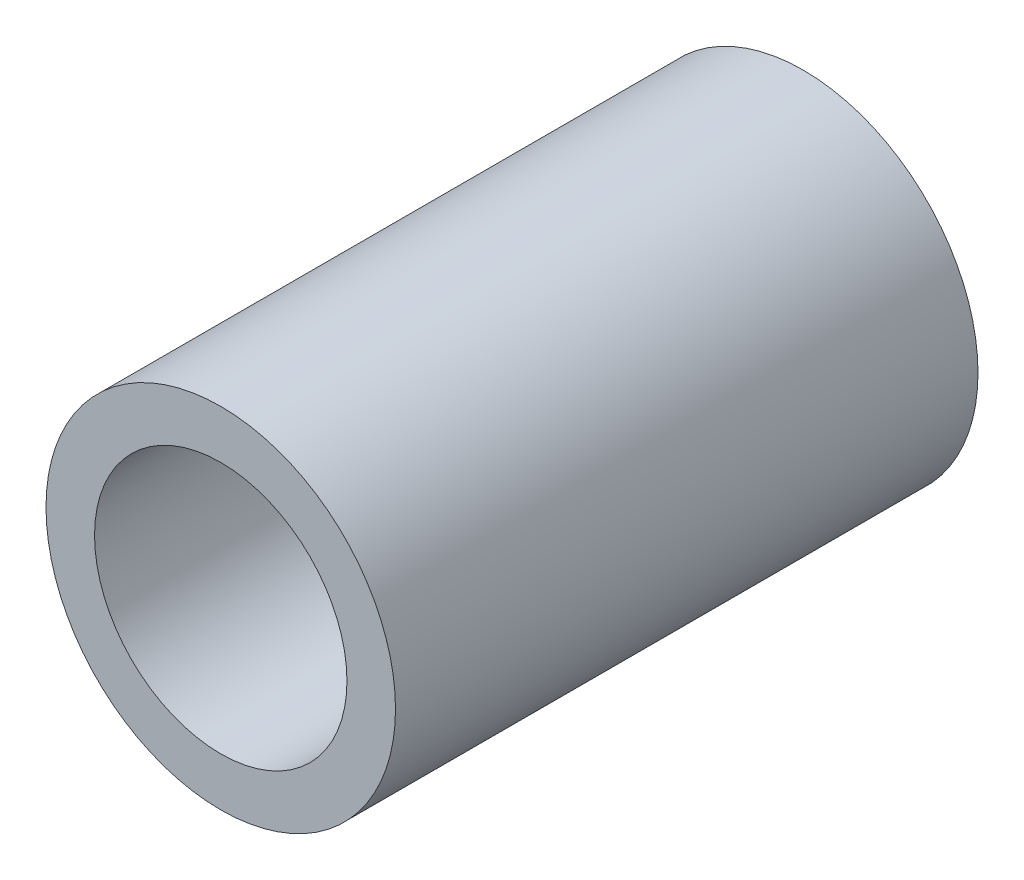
ISO-10303-21;
HEADER;
FILE_DESCRIPTION(('STEP AP214'),'2;1');
FILE_NAME('part.step','',(''),(''),'','','');
FILE_SCHEMA(('AUTOMOTIVE_DESIGN { 1 0 10303 214 1 1 1 1 }'));
ENDSEC;
DATA;
#1=APPLICATION_CONTEXT('core data for automotive mechanical design processes');
#2=APPLICATION_PROTOCOL_DEFINITION('international standard','automotive_design',2000,#1);
#3=PRODUCT_CONTEXT('',#1,'mechanical');
#4=PRODUCT('Part','Part','',(#3));
#5=PRODUCT_RELATED_PRODUCT_CATEGORY('part','',(#4));
#6=PRODUCT_DEFINITION_FORMATION('','',#4);
#7=PRODUCT_DEFINITION_CONTEXT('part definition',#1,'design');
#8=PRODUCT_DEFINITION('design','',#6,#7);
#9=PRODUCT_DEFINITION_SHAPE('','',#8);
#10=(LENGTH_UNIT() NAMED_UNIT(*) SI_UNIT(.MILLI.,.METRE.));
#11=(NAMED_UNIT(*) PLANE_ANGLE_UNIT() SI_UNIT($,.RADIAN.));
#12=(NAMED_UNIT(*) SI_UNIT($,.STERADIAN.) SOLID_ANGLE_UNIT());
#13=UNCERTAINTY_MEASURE_WITH_UNIT(LENGTH_MEASURE(1.E-05),#10,'distance_accuracy_value','');
#14=(GEOMETRIC_REPRESENTATION_CONTEXT(3) GLOBAL_UNCERTAINTY_ASSIGNED_CONTEXT((#13)) GLOBAL_UNIT_ASSIGNED_CONTEXT((#10,
#11,#12)) REPRESENTATION_CONTEXT('',''));
#15=CARTESIAN_POINT('',(0.,0.,0.));
#16=DIRECTION('',(0.,0.,1.));
#17=DIRECTION('',(1.,0.,0.));
#18=AXIS2_PLACEMENT_3D('',#15,#16,#17);
#19=CARTESIAN_POINT('',(0.,0.,30.));
#20=DIRECTION('',(0.,0.,1.));
#21=DIRECTION('',(1.,0.,0.));
#22=AXIS2_PLACEMENT_3D('',#19,#20,#21);
#23=PLANE('',#22);
#24=CARTESIAN_POINT('',(0.,0.,30.));
#25=DIRECTION('',(0.,0.,1.));
#26=DIRECTION('',(1.,0.,0.));
#27=AXIS2_PLACEMENT_3D('',#24,#25,#26);
#28=CIRCLE('',#27,9.);
#29=CARTESIAN_POINT('',(9.,0.,30.));
#30=VERTEX_POINT('',#29);
#31=EDGE_CURVE('E10',#30,#30,#28,.T.);
#32=ORIENTED_EDGE('',*,*,#31,.T.);
#33=EDGE_LOOP('',(#32));
#34=FACE_BOUND('',#33,.T.);
#35=CARTESIAN_POINT('',(0.,0.,30.));
#36=DIRECTION('',(0.,0.,1.));
#37=DIRECTION('',(1.,0.,0.));
#38=AXIS2_PLACEMENT_3D('',#35,#36,#37);
#39=CIRCLE('',#38,6.5);
#40=CARTESIAN_POINT('',(6.5,0.,30.));
#41=VERTEX_POINT('',#40);
#42=EDGE_CURVE('E41',#41,#41,#39,.T.);
#43=ORIENTED_EDGE('',*,*,#42,.F.);
#44=EDGE_LOOP('',(#43));
#45=FACE_BOUND('',#44,.T.);
#46=ADVANCED_FACE('F30',(#34,#45),#23,.T.);
#47=CARTESIAN_POINT('',(0.,0.,0.));
#48=DIRECTION('',(0.,0.,1.));
#49=DIRECTION('',(1.,0.,0.));
#50=AXIS2_PLACEMENT_3D('',#47,#48,#49);
#51=PLANE('',#50);
#52=CARTESIAN_POINT('',(0.,0.,0.));
#53=DIRECTION('',(0.,0.,1.));
#54=DIRECTION('',(1.,0.,0.));
#55=AXIS2_PLACEMENT_3D('',#52,#53,#54);
#56=CIRCLE('',#55,9.);
#57=CARTESIAN_POINT('',(9.,0.,0.));
#58=VERTEX_POINT('',#57);
#59=EDGE_CURVE('E34',#58,#58,#56,.T.);
#60=ORIENTED_EDGE('',*,*,#59,.F.);
#61=EDGE_LOOP('',(#60));
#62=FACE_BOUND('',#61,.T.);
#63=CARTESIAN_POINT('',(0.,0.,0.));
#64=DIRECTION('',(0.,0.,1.));
#65=DIRECTION('',(1.,0.,0.));
#66=AXIS2_PLACEMENT_3D('',#63,#64,#65);
#67=CIRCLE('',#66,6.5);
#68=CARTESIAN_POINT('',(6.5,0.,0.));
#69=VERTEX_POINT('',#68);
#70=EDGE_CURVE('E43',#69,#69,#67,.T.);
#71=ORIENTED_EDGE('',*,*,#70,.T.);
#72=EDGE_LOOP('',(#71));
#73=FACE_BOUND('',#72,.T.);
#74=ADVANCED_FACE('F53',(#62,#73),#51,.F.);
#75=CARTESIAN_POINT('',(0.,0.,30.));
#76=DIRECTION('',(0.,0.,-1.));
#77=DIRECTION('',(-1.,0.,0.));
#78=AXIS2_PLACEMENT_3D('',#75,#76,#77);
#79=CYLINDRICAL_SURFACE('',#78,9.);
#80=ORIENTED_EDGE('',*,*,#31,.F.);
#81=EDGE_LOOP('',(#80));
#82=FACE_BOUND('',#81,.T.);
#83=ORIENTED_EDGE('',*,*,#59,.T.);
#84=EDGE_LOOP('',(#83));
#85=FACE_BOUND('',#84,.T.);
#86=ADVANCED_FACE('F32',(#82,#85),#79,.T.);
#87=CARTESIAN_POINT('',(0.,0.,30.));
#88=DIRECTION('',(0.,0.,-1.));
#89=DIRECTION('',(-1.,0.,0.));
#90=AXIS2_PLACEMENT_3D('',#87,#88,#89);
#91=CYLINDRICAL_SURFACE('',#90,6.5);
#92=ORIENTED_EDGE('',*,*,#42,.T.);
#93=EDGE_LOOP('',(#92));
#94=FACE_BOUND('',#93,.T.);
#95=ORIENTED_EDGE('',*,*,#70,.F.);
#96=EDGE_LOOP('',(#95));
#97=FACE_BOUND('',#96,.T.);
#98=ADVANCED_FACE('F49',(#94,#97),#91,.F.);
#99=CLOSED_SHELL('',(#46,#74,#86,#98));
#100=MANIFOLD_SOLID_BREP('B2',#99);
#101=ADVANCED_BREP_SHAPE_REPRESENTATION('',(#18,#100),#14);
#102=SHAPE_DEFINITION_REPRESENTATION(#9,#101);
ENDSEC;
END-ISO-10303-21;
